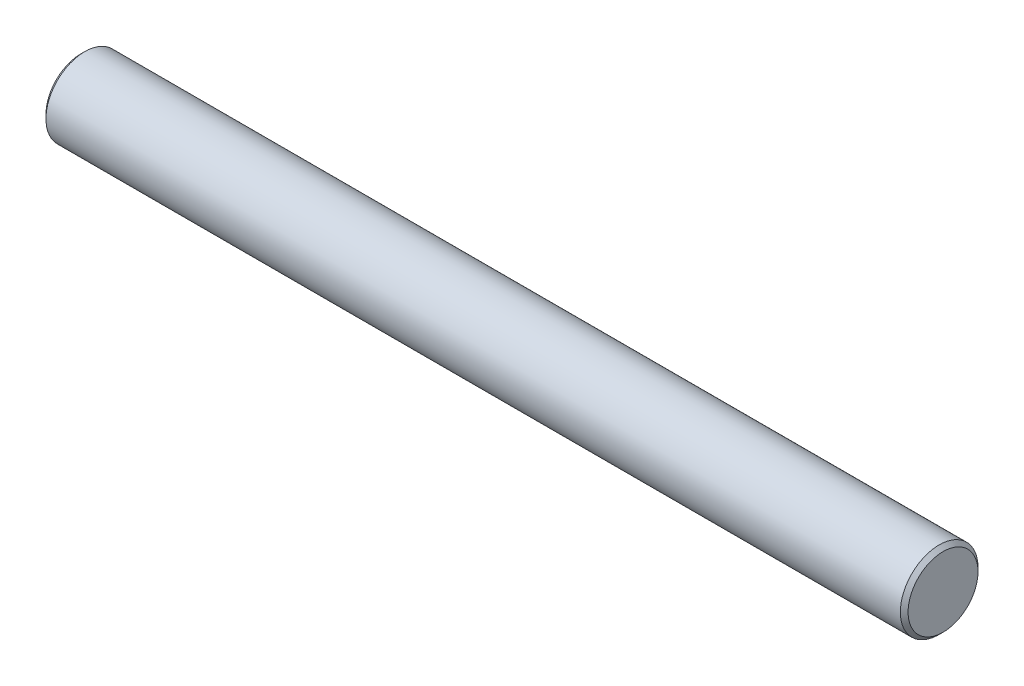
from build123d import *

# Parameters (mm, degrees)
SKETCH1_R      = 10
EXTRUDE1_DEPTH = 222
CHAMFER1_SIZE  = 1


with BuildPart() as part:
    # Sketch1 → Extrude1 (new body)
    with BuildSketch(Plane(origin=(0, 0, 0), x_dir=(0, 0, -1), z_dir=(1, 0, 0))):
        Circle(SKETCH1_R)
    extrude(amount=EXTRUDE1_DEPTH)

    # Chamfer1
    chamfer1_edges = [part.edges().sort_by_distance(p)[0] for p in [
        (0, 0, 10),
        (222, 0, 10),
    ]]
    chamfer(chamfer1_edges, length=CHAMFER1_SIZE)


solid = part.part
